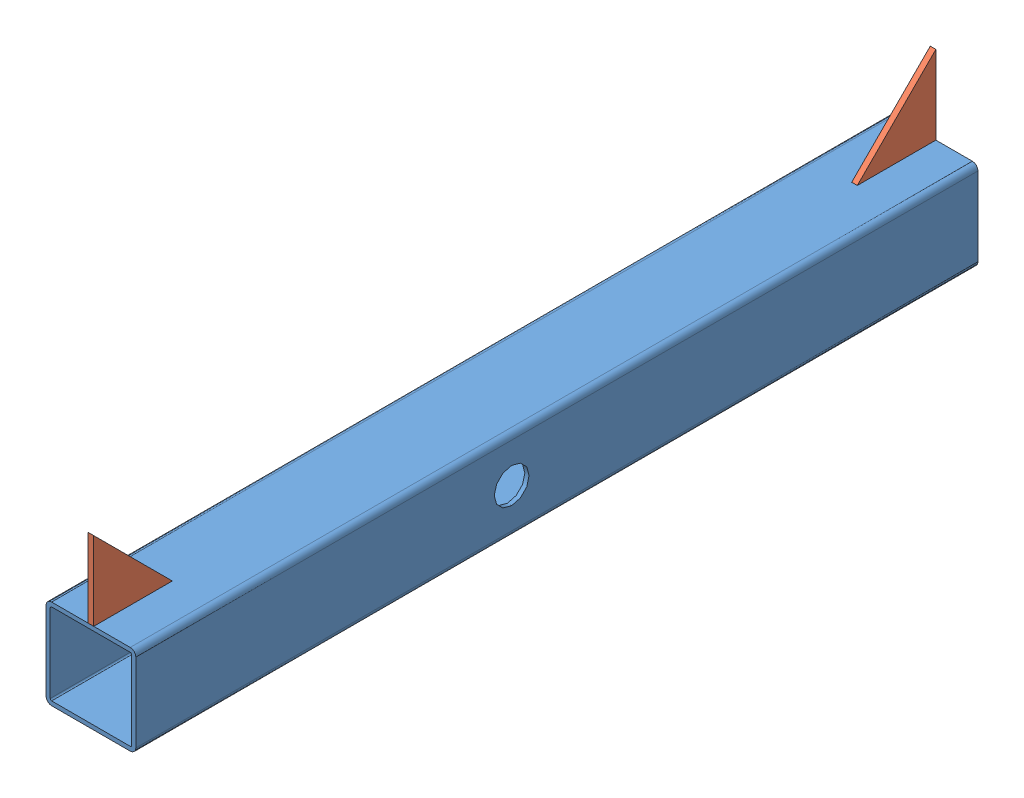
SolidWorks assembly 1080-C1010 FRONT CROSS MEMBER.SLDASM, configuration Default (file format 5000). Lengths in mm.
Overall size (101.6 190.5 952.5).
3 component instances, 2 part files, 6 mates.
Components (placement in the parent):
- 1080-C1011 4x4 TUBE CROSS-1: 1080-C1011 4x4 TUBE CROSS.SLDPRT [Default] at origin size (101.6 101.6 952.5)
- 1080-C1013 GUSSET-1: 1080-C1013 GUSSET.SLDPRT [Default] at (-3.175 50.8 -387.35) x (0 0 -1) z (1 0 0) size (88.9 88.9 6.35)
- 1080-C1013 GUSSET-2: 1080-C1013 GUSSET.SLDPRT [Default] at (3.175 50.8 387.35) x (0 0 1) z (-1 0 0) size (88.9 88.9 6.35)
Mates (geometry in assembly coordinates):
- Coincident4: coincident anti-aligned: plane of 1080-C1011 4x4 TUBE CROSS-1 through (-44.45 50.8 476.25) normal (0 1 0); plane of 1080-C1013 GUSSET-2 through (-3.175 50.8 387.35) normal (0 -1 0)
- Coincident6: coincident aligned: plane of 1080-C1011 4x4 TUBE CROSS-1 through (-44.45 44.45 476.25) normal (0 0 1); plane of 1080-C1013 GUSSET-2 through (-3.175 50.8 476.25) normal (0 0 1)
- Coincident10: coincident anti-aligned: plane of 1080-C1011 4x4 TUBE CROSS-1 through (-44.45 50.8 476.25) normal (0 1 0); plane of 1080-C1013 GUSSET-1 through (3.175 50.8 -387.35) normal (0 -1 0)
- Coincident12: coincident aligned: plane of 1080-C1011 4x4 TUBE CROSS-1 through (-44.45 44.45 -476.25) normal (0 0 -1); plane of 1080-C1013 GUSSET-1 through (3.175 50.8 -476.25) normal (0 0 -1)
- Width1: width anti-aligned: plane of 1080-C1011 4x4 TUBE CROSS-1 through (50.8 44.45 476.25) normal (1 0 0); plane of 1080-C1011 4x4 TUBE CROSS-1 through (-50.8 44.45 476.25) normal (-1 0 0); plane of 1080-C1013 GUSSET-2 through (-3.175 50.8 387.35) normal (-1 0 0); plane of 1080-C1013 GUSSET-2 through (3.175 50.8 387.35) normal (1 0 0)
- Width2: width anti-aligned: plane of 1080-C1011 4x4 TUBE CROSS-1 through (50.8 44.45 476.25) normal (1 0 0); plane of 1080-C1011 4x4 TUBE CROSS-1 through (-50.8 44.45 476.25) normal (-1 0 0); plane of 1080-C1013 GUSSET-1 through (-3.175 50.8 -387.35) normal (-1 0 0); plane of 1080-C1013 GUSSET-1 through (3.175 50.8 -387.35) normal (1 0 0)
